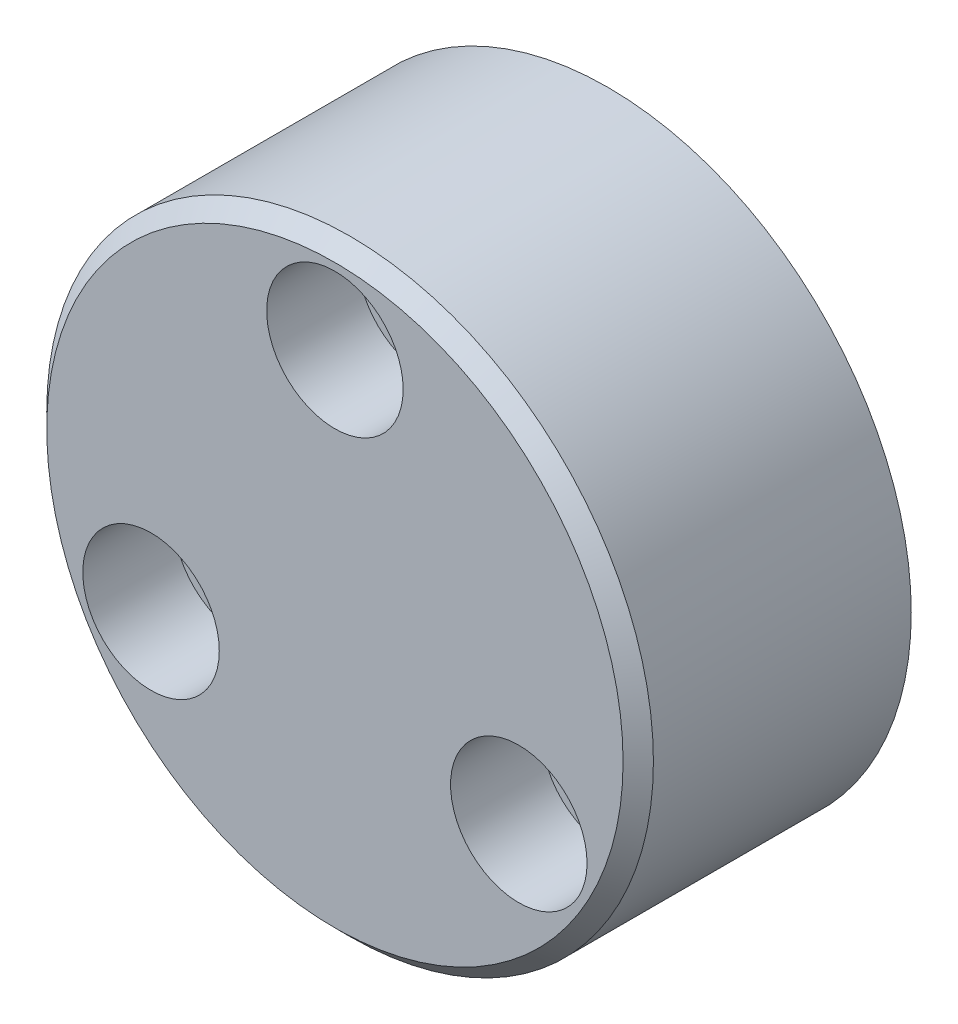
ISO-10303-21;
HEADER;
FILE_DESCRIPTION(('STEP AP214'),'2;1');
FILE_NAME('part.step','',(''),(''),'','','');
FILE_SCHEMA(('AUTOMOTIVE_DESIGN { 1 0 10303 214 1 1 1 1 }'));
ENDSEC;
DATA;
#1=APPLICATION_CONTEXT('core data for automotive mechanical design processes');
#2=APPLICATION_PROTOCOL_DEFINITION('international standard','automotive_design',2000,#1);
#3=PRODUCT_CONTEXT('',#1,'mechanical');
#4=PRODUCT('Part','Part','',(#3));
#5=PRODUCT_RELATED_PRODUCT_CATEGORY('part','',(#4));
#6=PRODUCT_DEFINITION_FORMATION('','',#4);
#7=PRODUCT_DEFINITION_CONTEXT('part definition',#1,'design');
#8=PRODUCT_DEFINITION('design','',#6,#7);
#9=PRODUCT_DEFINITION_SHAPE('','',#8);
#10=(LENGTH_UNIT() NAMED_UNIT(*) SI_UNIT(.MILLI.,.METRE.));
#11=(NAMED_UNIT(*) PLANE_ANGLE_UNIT() SI_UNIT($,.RADIAN.));
#12=(NAMED_UNIT(*) SI_UNIT($,.STERADIAN.) SOLID_ANGLE_UNIT());
#13=UNCERTAINTY_MEASURE_WITH_UNIT(LENGTH_MEASURE(1.E-05),#10,'distance_accuracy_value','');
#14=(GEOMETRIC_REPRESENTATION_CONTEXT(3) GLOBAL_UNCERTAINTY_ASSIGNED_CONTEXT((#13)) GLOBAL_UNIT_ASSIGNED_CONTEXT((#10,
#11,#12)) REPRESENTATION_CONTEXT('',''));
#15=CARTESIAN_POINT('',(0.,0.,0.));
#16=DIRECTION('',(0.,0.,1.));
#17=DIRECTION('',(1.,0.,0.));
#18=AXIS2_PLACEMENT_3D('',#15,#16,#17);
#19=CARTESIAN_POINT('',(12.1243556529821,-7.00000000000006,18.));
#20=DIRECTION('',(0.,0.,-1.));
#21=DIRECTION('',(-1.,0.,0.));
#22=AXIS2_PLACEMENT_3D('',#19,#20,#21);
#23=CYLINDRICAL_SURFACE('',#22,2.75);
#24=CARTESIAN_POINT('',(12.1243556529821,-7.00000000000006,0.));
#25=DIRECTION('',(0.,0.,1.));
#26=DIRECTION('',(1.,0.,0.));
#27=AXIS2_PLACEMENT_3D('',#24,#25,#26);
#28=CIRCLE('',#27,2.75);
#29=CARTESIAN_POINT('',(14.8743556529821,-7.00000000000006,0.));
#30=VERTEX_POINT('',#29);
#31=EDGE_CURVE('E101',#30,#30,#28,.T.);
#32=ORIENTED_EDGE('',*,*,#31,.F.);
#33=EDGE_LOOP('',(#32));
#34=FACE_BOUND('',#33,.T.);
#35=CARTESIAN_POINT('',(12.1243556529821,-7.00000000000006,12.));
#36=DIRECTION('',(0.,0.,1.));
#37=DIRECTION('',(1.,0.,0.));
#38=AXIS2_PLACEMENT_3D('',#35,#36,#37);
#39=CIRCLE('',#38,2.75);
#40=CARTESIAN_POINT('',(14.8743556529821,-7.00000000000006,12.));
#41=VERTEX_POINT('',#40);
#42=EDGE_CURVE('E83',#41,#41,#39,.T.);
#43=ORIENTED_EDGE('',*,*,#42,.T.);
#44=EDGE_LOOP('',(#43));
#45=FACE_BOUND('',#44,.T.);
#46=ADVANCED_FACE('F37',(#34,#45),#23,.F.);
#47=CARTESIAN_POINT('',(-12.1243556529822,-6.99999999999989,18.));
#48=DIRECTION('',(0.,0.,-1.));
#49=DIRECTION('',(-1.,0.,0.));
#50=AXIS2_PLACEMENT_3D('',#47,#48,#49);
#51=CYLINDRICAL_SURFACE('',#50,2.75);
#52=CARTESIAN_POINT('',(-12.1243556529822,-6.99999999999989,0.));
#53=DIRECTION('',(0.,0.,1.));
#54=DIRECTION('',(1.,0.,0.));
#55=AXIS2_PLACEMENT_3D('',#52,#53,#54);
#56=CIRCLE('',#55,2.75);
#57=CARTESIAN_POINT('',(-9.37435565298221,-6.99999999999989,0.));
#58=VERTEX_POINT('',#57);
#59=EDGE_CURVE('E98',#58,#58,#56,.T.);
#60=ORIENTED_EDGE('',*,*,#59,.F.);
#61=EDGE_LOOP('',(#60));
#62=FACE_BOUND('',#61,.T.);
#63=CARTESIAN_POINT('',(-12.1243556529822,-6.99999999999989,12.));
#64=DIRECTION('',(0.,0.,1.));
#65=DIRECTION('',(1.,0.,0.));
#66=AXIS2_PLACEMENT_3D('',#63,#64,#65);
#67=CIRCLE('',#66,2.75);
#68=CARTESIAN_POINT('',(-9.37435565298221,-6.99999999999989,12.));
#69=VERTEX_POINT('',#68);
#70=EDGE_CURVE('E90',#69,#69,#67,.T.);
#71=ORIENTED_EDGE('',*,*,#70,.T.);
#72=EDGE_LOOP('',(#71));
#73=FACE_BOUND('',#72,.T.);
#74=ADVANCED_FACE('F168',(#62,#73),#51,.F.);
#75=CARTESIAN_POINT('',(0.,14.,18.));
#76=DIRECTION('',(0.,0.,-1.));
#77=DIRECTION('',(-1.,0.,0.));
#78=AXIS2_PLACEMENT_3D('',#75,#76,#77);
#79=CYLINDRICAL_SURFACE('',#78,2.75);
#80=CARTESIAN_POINT('',(0.,14.,0.));
#81=DIRECTION('',(0.,0.,1.));
#82=DIRECTION('',(1.,0.,0.));
#83=AXIS2_PLACEMENT_3D('',#80,#81,#82);
#84=CIRCLE('',#83,2.75);
#85=CARTESIAN_POINT('',(2.75,14.,0.));
#86=VERTEX_POINT('',#85);
#87=EDGE_CURVE('E104',#86,#86,#84,.T.);
#88=ORIENTED_EDGE('',*,*,#87,.F.);
#89=EDGE_LOOP('',(#88));
#90=FACE_BOUND('',#89,.T.);
#91=CARTESIAN_POINT('',(0.,14.,12.));
#92=DIRECTION('',(0.,0.,1.));
#93=DIRECTION('',(1.,0.,0.));
#94=AXIS2_PLACEMENT_3D('',#91,#92,#93);
#95=CIRCLE('',#94,2.75);
#96=CARTESIAN_POINT('',(2.75,14.,12.));
#97=VERTEX_POINT('',#96);
#98=EDGE_CURVE('E97',#97,#97,#95,.T.);
#99=ORIENTED_EDGE('',*,*,#98,.T.);
#100=EDGE_LOOP('',(#99));
#101=FACE_BOUND('',#100,.T.);
#102=ADVANCED_FACE('F171',(#90,#101),#79,.F.);
#103=CARTESIAN_POINT('',(0.,0.,18.));
#104=DIRECTION('',(0.,0.,1.));
#105=DIRECTION('',(1.,0.,0.));
#106=AXIS2_PLACEMENT_3D('',#103,#104,#105);
#107=PLANE('',#106);
#108=CARTESIAN_POINT('',(12.1243556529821,-7.00000000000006,18.));
#109=DIRECTION('',(0.,0.,1.));
#110=DIRECTION('',(1.,0.,0.));
#111=AXIS2_PLACEMENT_3D('',#108,#109,#110);
#112=CIRCLE('',#111,4.5);
#113=CARTESIAN_POINT('',(16.6243556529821,-7.00000000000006,18.));
#114=VERTEX_POINT('',#113);
#115=EDGE_CURVE('E77',#114,#114,#112,.T.);
#116=ORIENTED_EDGE('',*,*,#115,.F.);
#117=EDGE_LOOP('',(#116));
#118=FACE_BOUND('',#117,.T.);
#119=CARTESIAN_POINT('',(-12.1243556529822,-6.99999999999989,18.));
#120=DIRECTION('',(0.,0.,1.));
#121=DIRECTION('',(1.,0.,0.));
#122=AXIS2_PLACEMENT_3D('',#119,#120,#121);
#123=CIRCLE('',#122,4.5);
#124=CARTESIAN_POINT('',(-7.62435565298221,-6.99999999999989,18.));
#125=VERTEX_POINT('',#124);
#126=EDGE_CURVE('E84',#125,#125,#123,.T.);
#127=ORIENTED_EDGE('',*,*,#126,.F.);
#128=EDGE_LOOP('',(#127));
#129=FACE_BOUND('',#128,.T.);
#130=CARTESIAN_POINT('',(0.,14.,18.));
#131=DIRECTION('',(0.,0.,1.));
#132=DIRECTION('',(1.,0.,0.));
#133=AXIS2_PLACEMENT_3D('',#130,#131,#132);
#134=CIRCLE('',#133,4.5);
#135=CARTESIAN_POINT('',(4.5,14.,18.));
#136=VERTEX_POINT('',#135);
#137=EDGE_CURVE('E91',#136,#136,#134,.T.);
#138=ORIENTED_EDGE('',*,*,#137,.F.);
#139=EDGE_LOOP('',(#138));
#140=FACE_BOUND('',#139,.T.);
#141=CARTESIAN_POINT('',(0.,0.,18.));
#142=DIRECTION('',(0.,0.,1.));
#143=DIRECTION('',(1.,0.,0.));
#144=AXIS2_PLACEMENT_3D('',#141,#142,#143);
#145=CIRCLE('',#144,19.);
#146=CARTESIAN_POINT('',(19.,0.,18.));
#147=VERTEX_POINT('',#146);
#148=EDGE_CURVE('E110',#147,#147,#145,.T.);
#149=ORIENTED_EDGE('',*,*,#148,.T.);
#150=EDGE_LOOP('',(#149));
#151=FACE_BOUND('',#150,.T.);
#152=ADVANCED_FACE('F178',(#118,#129,#140,#151),#107,.T.);
#153=CARTESIAN_POINT('',(0.,0.,0.));
#154=DIRECTION('',(0.,0.,1.));
#155=DIRECTION('',(1.,0.,0.));
#156=AXIS2_PLACEMENT_3D('',#153,#154,#155);
#157=PLANE('',#156);
#158=CARTESIAN_POINT('',(0.,0.,0.));
#159=DIRECTION('',(0.,0.,-1.));
#160=DIRECTION('',(-1.,0.,0.));
#161=AXIS2_PLACEMENT_3D('',#158,#159,#160);
#162=CIRCLE('',#161,3.99999999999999);
#163=CARTESIAN_POINT('',(-3.99999999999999,0.,0.));
#164=VERTEX_POINT('',#163);
#165=EDGE_CURVE('E65',#164,#164,#162,.T.);
#166=ORIENTED_EDGE('',*,*,#165,.F.);
#167=EDGE_LOOP('',(#166));
#168=FACE_BOUND('',#167,.T.);
#169=ORIENTED_EDGE('',*,*,#31,.T.);
#170=EDGE_LOOP('',(#169));
#171=FACE_BOUND('',#170,.T.);
#172=CARTESIAN_POINT('',(0.,0.,0.));
#173=DIRECTION('',(0.,0.,1.));
#174=DIRECTION('',(1.,0.,0.));
#175=AXIS2_PLACEMENT_3D('',#172,#173,#174);
#176=CIRCLE('',#175,20.);
#177=CARTESIAN_POINT('',(20.,0.,0.));
#178=VERTEX_POINT('',#177);
#179=EDGE_CURVE('E107',#178,#178,#176,.T.);
#180=ORIENTED_EDGE('',*,*,#179,.F.);
#181=EDGE_LOOP('',(#180));
#182=FACE_BOUND('',#181,.T.);
#183=ORIENTED_EDGE('',*,*,#87,.T.);
#184=EDGE_LOOP('',(#183));
#185=FACE_BOUND('',#184,.T.);
#186=ORIENTED_EDGE('',*,*,#59,.T.);
#187=EDGE_LOOP('',(#186));
#188=FACE_BOUND('',#187,.T.);
#189=ADVANCED_FACE('F180',(#168,#171,#182,#185,#188),#157,.F.);
#190=CARTESIAN_POINT('',(0.,0.,18.));
#191=DIRECTION('',(0.,0.,-1.));
#192=DIRECTION('',(-1.,0.,0.));
#193=AXIS2_PLACEMENT_3D('',#190,#191,#192);
#194=CYLINDRICAL_SURFACE('',#193,20.);
#195=CARTESIAN_POINT('',(0.,-20.,14.));
#196=CARTESIAN_POINT('',(0.164652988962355,-20.0000061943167,14.0000104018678));
#197=CARTESIAN_POINT('',(0.329207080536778,-19.9979626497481,13.9932192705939));
#198=CARTESIAN_POINT('',(0.657107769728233,-19.9898752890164,13.9661779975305));
#199=CARTESIAN_POINT('',(0.820454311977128,-19.983831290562,13.9459272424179));
#200=CARTESIAN_POINT('',(1.3069899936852,-19.959876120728,13.8651130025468));
#201=CARTESIAN_POINT('',(1.62688975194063,-19.9361415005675,13.7844873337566));
#202=CARTESIAN_POINT('',(2.09209536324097,-19.890895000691,13.6258450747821));
#203=CARTESIAN_POINT('',(2.24469091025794,-19.8742101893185,13.5666977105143));
#204=CARTESIAN_POINT('',(2.5442798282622,-19.8380770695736,13.4362909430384));
#205=CARTESIAN_POINT('',(2.69127506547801,-19.8186296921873,13.365035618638));
#206=CARTESIAN_POINT('',(2.97877080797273,-19.7774632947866,13.2109078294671));
#207=CARTESIAN_POINT('',(3.11926848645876,-19.755743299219,13.1280303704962));
#208=CARTESIAN_POINT('',(3.39282129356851,-19.7106054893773,12.9512893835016));
#209=CARTESIAN_POINT('',(3.52587882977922,-19.6871882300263,12.8574294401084));
#210=CARTESIAN_POINT('',(3.78718937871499,-19.6386181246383,12.6567206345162));
#211=CARTESIAN_POINT('',(3.91522491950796,-19.6134358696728,12.5495957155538));
#212=CARTESIAN_POINT('',(4.16183570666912,-19.5625911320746,12.3251488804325));
#213=CARTESIAN_POINT('',(4.28041413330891,-19.5369288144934,12.2078304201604));
#214=CARTESIAN_POINT('',(4.5074763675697,-19.4857950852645,11.9636431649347));
#215=CARTESIAN_POINT('',(4.61595484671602,-19.4603237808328,11.8367693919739));
#216=CARTESIAN_POINT('',(4.82200644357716,-19.4102934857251,11.5743632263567));
#217=CARTESIAN_POINT('',(4.91958354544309,-19.3857341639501,11.4388340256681));
#218=CARTESIAN_POINT('',(5.10532440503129,-19.3376596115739,11.1567125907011));
#219=CARTESIAN_POINT('',(5.19322086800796,-19.3141812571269,11.0099378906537));
#220=CARTESIAN_POINT('',(5.35625892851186,-19.2696038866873,10.7091945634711));
#221=CARTESIAN_POINT('',(5.43140551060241,-19.2485039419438,10.5552287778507));
#222=CARTESIAN_POINT('',(5.56839058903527,-19.2093234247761,10.2410703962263));
#223=CARTESIAN_POINT('',(5.63022616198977,-19.1912435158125,10.0808764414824));
#224=CARTESIAN_POINT('',(5.7400034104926,-19.1586962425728,9.75551241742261));
#225=CARTESIAN_POINT('',(5.78795116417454,-19.1442272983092,9.59034456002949));
#226=CARTESIAN_POINT('',(5.86841419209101,-19.1197132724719,9.26082523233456));
#227=CARTESIAN_POINT('',(5.90131899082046,-19.1095570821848,9.0965771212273));
#228=CARTESIAN_POINT('',(5.95328671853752,-19.0934313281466,8.76576642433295));
#229=CARTESIAN_POINT('',(5.9723552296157,-19.0874600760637,8.59920479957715));
#230=CARTESIAN_POINT('',(5.99648748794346,-19.0798925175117,8.26497342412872));
#231=CARTESIAN_POINT('',(6.00155147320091,-19.0782961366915,8.09730369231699));
#232=CARTESIAN_POINT('',(5.99762541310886,-19.0795307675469,7.76214720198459));
#233=CARTESIAN_POINT('',(5.9886356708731,-19.0823616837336,7.59466043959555));
#234=CARTESIAN_POINT('',(5.95727255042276,-19.0921753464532,7.26722111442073));
#235=CARTESIAN_POINT('',(5.93539727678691,-19.0990035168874,7.10721589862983));
#236=CARTESIAN_POINT('',(5.87886408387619,-19.1164806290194,6.78963681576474));
#237=CARTESIAN_POINT('',(5.8442018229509,-19.1271308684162,6.63206379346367));
#238=CARTESIAN_POINT('',(5.76240333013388,-19.151932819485,6.32052471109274));
#239=CARTESIAN_POINT('',(5.71527077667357,-19.166083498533,6.16655760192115));
#240=CARTESIAN_POINT('',(5.60889138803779,-19.197484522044,5.86313368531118));
#241=CARTESIAN_POINT('',(5.54963996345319,-19.2147360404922,5.71367861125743));
#242=CARTESIAN_POINT('',(5.41860914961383,-19.2521004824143,5.4183119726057));
#243=CARTESIAN_POINT('',(5.34667354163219,-19.2722484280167,5.27247402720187));
#244=CARTESIAN_POINT('',(5.19135839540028,-19.3146649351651,4.98732711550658));
#245=CARTESIAN_POINT('',(5.1079746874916,-19.3369342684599,4.84802055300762));
#246=CARTESIAN_POINT('',(4.84149472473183,-19.4060193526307,4.44123221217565));
#247=CARTESIAN_POINT('',(4.64196639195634,-19.4551429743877,4.18465004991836));
#248=CARTESIAN_POINT('',(4.19522722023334,-19.5564461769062,3.69720964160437));
#249=CARTESIAN_POINT('',(3.94637308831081,-19.6086677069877,3.46787312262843));
#250=CARTESIAN_POINT('',(3.41305957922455,-19.708488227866,3.05379628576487));
#251=CARTESIAN_POINT('',(3.12859796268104,-19.7560869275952,2.8690587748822));
#252=CARTESIAN_POINT('',(2.52941838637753,-19.8417268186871,2.54855699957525));
#253=CARTESIAN_POINT('',(2.21451053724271,-19.8797018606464,2.41312903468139));
#254=CARTESIAN_POINT('',(1.56498212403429,-19.9413407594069,2.19760253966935));
#255=CARTESIAN_POINT('',(1.23036708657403,-19.9650086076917,2.11748857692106));
#256=CARTESIAN_POINT('',(0.563808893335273,-19.9947346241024,2.01739100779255));
#257=CARTESIAN_POINT('',(0.232200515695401,-20.001394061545,1.99535339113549));
#258=CARTESIAN_POINT('',(-0.429998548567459,-19.998116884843,2.00627688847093));
#259=CARTESIAN_POINT('',(-0.760589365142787,-19.9881824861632,2.03923066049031));
#260=CARTESIAN_POINT('',(-1.4036138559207,-19.9532280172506,2.15753768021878));
#261=CARTESIAN_POINT('',(-1.71628897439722,-19.928553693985,2.24169078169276));
#262=CARTESIAN_POINT('',(-2.32302067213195,-19.8669734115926,2.45857570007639));
#263=CARTESIAN_POINT('',(-2.61707500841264,-19.8300659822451,2.59131335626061));
#264=CARTESIAN_POINT('',(-3.18574067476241,-19.7467880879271,2.90500211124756));
#265=CARTESIAN_POINT('',(-3.45974481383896,-19.7002184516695,3.08699757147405));
#266=CARTESIAN_POINT('',(-3.97412373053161,-19.6029315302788,3.49293881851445));
#267=CARTESIAN_POINT('',(-4.21449005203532,-19.5522132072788,3.71689512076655));
#268=CARTESIAN_POINT('',(-4.54922702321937,-19.4760967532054,4.08420798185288));
#269=CARTESIAN_POINT('',(-4.6581855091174,-19.45026064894,4.21447921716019));
#270=CARTESIAN_POINT('',(-4.8647507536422,-19.3996259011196,4.48389870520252));
#271=CARTESIAN_POINT('',(-4.96236157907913,-19.3748268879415,4.62304374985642));
#272=CARTESIAN_POINT('',(-5.14557811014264,-19.3269761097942,4.90937901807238));
#273=CARTESIAN_POINT('',(-5.23117910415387,-19.3039250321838,5.05657236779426));
#274=CARTESIAN_POINT('',(-5.38966081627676,-19.2602780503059,5.3579321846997));
#275=CARTESIAN_POINT('',(-5.46254677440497,-19.2396811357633,5.5120957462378));
#276=CARTESIAN_POINT('',(-5.59476151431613,-19.2016499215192,5.82572301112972));
#277=CARTESIAN_POINT('',(-5.65414703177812,-19.1842024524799,5.98516118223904));
#278=CARTESIAN_POINT('',(-5.75922373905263,-19.1529201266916,6.30876708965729));
#279=CARTESIAN_POINT('',(-5.80492040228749,-19.1390838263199,6.47293290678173));
#280=CARTESIAN_POINT('',(-5.88222586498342,-19.1154663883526,6.80482314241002));
#281=CARTESIAN_POINT('',(-5.91383588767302,-19.1056848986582,6.97254725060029));
#282=CARTESIAN_POINT('',(-5.96266568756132,-19.0905022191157,7.31027182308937));
#283=CARTESIAN_POINT('',(-5.97988601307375,-19.0851008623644,7.48027220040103));
#284=CARTESIAN_POINT('',(-5.99934947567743,-19.0789911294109,7.81405931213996));
#285=CARTESIAN_POINT('',(-6.00218967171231,-19.07809567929,7.97780809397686));
#286=CARTESIAN_POINT('',(-5.99447696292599,-19.0805205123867,8.30501633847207));
#287=CARTESIAN_POINT('',(-5.98391947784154,-19.0838422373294,8.46847568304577));
#288=CARTESIAN_POINT('',(-5.94950873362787,-19.0945978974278,8.79378067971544));
#289=CARTESIAN_POINT('',(-5.9256610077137,-19.1020301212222,8.95562697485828));
#290=CARTESIAN_POINT('',(-5.86487874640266,-19.120779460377,9.27667504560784));
#291=CARTESIAN_POINT('',(-5.82793930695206,-19.1320980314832,9.43587580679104));
#292=CARTESIAN_POINT('',(-5.74185426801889,-19.1581079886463,9.74844216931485));
#293=CARTESIAN_POINT('',(-5.69287144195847,-19.1727542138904,9.90185644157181));
#294=CARTESIAN_POINT('',(-5.58284269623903,-19.205081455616,10.2040260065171));
#295=CARTESIAN_POINT('',(-5.52179244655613,-19.2227635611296,10.352779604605));
#296=CARTESIAN_POINT('',(-5.38811476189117,-19.2606604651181,10.6446121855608));
#297=CARTESIAN_POINT('',(-5.31548980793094,-19.2808747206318,10.7876923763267));
#298=CARTESIAN_POINT('',(-5.15913622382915,-19.3232987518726,11.0674087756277));
#299=CARTESIAN_POINT('',(-5.0754033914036,-19.3455092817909,11.2040425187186));
#300=CARTESIAN_POINT('',(-4.89419285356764,-19.3921618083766,11.4748184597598));
#301=CARTESIAN_POINT('',(-4.79632829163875,-19.4166553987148,11.6086929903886));
#302=CARTESIAN_POINT('',(-4.58990823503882,-19.4664844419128,11.8678412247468));
#303=CARTESIAN_POINT('',(-4.48134875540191,-19.4918202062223,11.9931116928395));
#304=CARTESIAN_POINT('',(-4.25427156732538,-19.5426381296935,12.2342170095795));
#305=CARTESIAN_POINT('',(-4.13575499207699,-19.5681202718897,12.3500529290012));
#306=CARTESIAN_POINT('',(-3.88944109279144,-19.6185640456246,12.5716188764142));
#307=CARTESIAN_POINT('',(-3.76164036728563,-19.6435254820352,12.6773451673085));
#308=CARTESIAN_POINT('',(-3.49372933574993,-19.6929668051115,12.8808781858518));
#309=CARTESIAN_POINT('',(-3.35336894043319,-19.7174114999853,12.9783646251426));
#310=CARTESIAN_POINT('',(-3.06460835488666,-19.7643509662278,13.1611406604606));
#311=CARTESIAN_POINT('',(-2.91620818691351,-19.7868457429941,13.24643029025));
#312=CARTESIAN_POINT('',(-2.61242605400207,-19.8292394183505,13.4041191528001));
#313=CARTESIAN_POINT('',(-2.45704684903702,-19.8491393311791,13.4765234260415));
#314=CARTESIAN_POINT('',(-2.14034959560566,-19.8857816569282,13.6078775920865));
#315=CARTESIAN_POINT('',(-1.9790319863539,-19.902524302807,13.6668284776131));
#316=CARTESIAN_POINT('',(-1.66920359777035,-19.9307619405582,13.765175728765));
#317=CARTESIAN_POINT('',(-1.52117718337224,-19.9426273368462,13.805991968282));
#318=CARTESIAN_POINT('',(-1.22223078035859,-19.963183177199,13.8762044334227));
#319=CARTESIAN_POINT('',(-1.07131010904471,-19.9718728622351,13.9055979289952));
#320=CARTESIAN_POINT('',(-0.615632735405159,-19.9928210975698,13.9762165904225));
#321=CARTESIAN_POINT('',(-0.307643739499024,-19.9999884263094,13.9999805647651));
#322=CARTESIAN_POINT('',(0.,-20.,14.));
#323=B_SPLINE_CURVE_WITH_KNOTS('',3,(#195,#196,#197,#198,#199,#200,#201,#202,#203,#204,#205,
#206,#207,#208,#209,#210,#211,#212,#213,#214,#215,#216,#217,#218,#219,#220,#221,#222,#223,#224,
#225,#226,#227,#228,#229,#230,#231,#232,#233,#234,#235,#236,#237,#238,#239,#240,#241,#242,#243,
#244,#245,#246,#247,#248,#249,#250,#251,#252,#253,#254,#255,#256,#257,#258,#259,#260,#261,#262,
#263,#264,#265,#266,#267,#268,#269,#270,#271,#272,#273,#274,#275,#276,#277,#278,#279,#280,#281,
#282,#283,#284,#285,#286,#287,#288,#289,#290,#291,#292,#293,#294,#295,#296,#297,#298,#299,#300,
#301,#302,#303,#304,#305,#306,#307,#308,#309,#310,#311,#312,#313,#314,#315,#316,#317,#318,#319,
#320,#321,#322),.UNSPECIFIED.,.T.,.F.,(4,2,2,2,2,2,2,2,2,2,2,2,2,2,2,2,2,2,2,2,2,2,2,2,2,2,2,2,
2,2,2,2,2,2,2,2,2,2,2,2,2,2,2,2,2,2,2,2,2,2,2,2,2,2,2,2,2,2,2,2,2,2,2,4),(0.,0.493608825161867,
0.987240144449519,1.97386718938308,2.46696137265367,2.95988977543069,3.4530306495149,
3.9460110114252,4.45191823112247,4.95765459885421,5.46365628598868,5.9694724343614,
6.48689212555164,7.00410906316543,7.52143947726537,8.03854313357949,8.54137016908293,
9.04399423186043,9.54660975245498,10.0492144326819,10.5335590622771,11.0180682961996,
11.5024347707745,11.9869850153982,12.477983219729,12.9691607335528,13.9507580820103,
14.9733478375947,15.9960019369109,17.0255055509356,18.0547218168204,19.0470160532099,
20.0391778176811,21.0089335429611,21.9788058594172,22.9711159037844,23.9636749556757,
24.4785258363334,24.9931916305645,25.5080587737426,26.022713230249,26.535163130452,
27.0474078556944,27.5596080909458,28.0717888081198,28.5625187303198,29.0534164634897,
29.5441099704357,30.0349874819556,30.5195637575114,31.0043142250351,31.4889609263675,
31.9737915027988,32.476111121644,32.9786186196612,33.4810690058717,33.983704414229,
34.5009771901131,35.0182485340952,35.5353170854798,36.0523474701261,36.5138710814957,
36.9755049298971,37.8977819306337),.UNSPECIFIED.);
#324=CARTESIAN_POINT('',(0.,-20.,14.));
#325=VERTEX_POINT('',#324);
#326=EDGE_CURVE('E76',#325,#325,#323,.T.);
#327=ORIENTED_EDGE('',*,*,#326,.T.);
#328=EDGE_LOOP('',(#327));
#329=FACE_BOUND('',#328,.T.);
#330=CARTESIAN_POINT('',(0.,0.,17.));
#331=DIRECTION('',(0.,0.,1.));
#332=DIRECTION('',(1.,0.,0.));
#333=AXIS2_PLACEMENT_3D('',#330,#331,#332);
#334=CIRCLE('',#333,20.);
#335=CARTESIAN_POINT('',(20.,0.,17.));
#336=VERTEX_POINT('',#335);
#337=EDGE_CURVE('E113',#336,#336,#334,.F.);
#338=ORIENTED_EDGE('',*,*,#337,.T.);
#339=EDGE_LOOP('',(#338));
#340=FACE_BOUND('',#339,.T.);
#341=ORIENTED_EDGE('',*,*,#179,.T.);
#342=EDGE_LOOP('',(#341));
#343=FACE_BOUND('',#342,.T.);
#344=ADVANCED_FACE('F39',(#329,#340,#343),#194,.T.);
#345=CARTESIAN_POINT('',(0.,0.,18.));
#346=DIRECTION('',(0.,0.,-1.));
#347=DIRECTION('',(-1.,0.,0.));
#348=AXIS2_PLACEMENT_3D('',#345,#346,#347);
#349=CONICAL_SURFACE('',#348,19.,0.785398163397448);
#350=ORIENTED_EDGE('',*,*,#337,.F.);
#351=EDGE_LOOP('',(#350));
#352=FACE_BOUND('',#351,.T.);
#353=ORIENTED_EDGE('',*,*,#148,.F.);
#354=EDGE_LOOP('',(#353));
#355=FACE_BOUND('',#354,.T.);
#356=ADVANCED_FACE('F163',(#352,#355),#349,.T.);
#357=CARTESIAN_POINT('',(0.,14.,12.));
#358=DIRECTION('',(0.,0.,1.));
#359=DIRECTION('',(1.,0.,0.));
#360=AXIS2_PLACEMENT_3D('',#357,#358,#359);
#361=CYLINDRICAL_SURFACE('',#360,4.5);
#362=CARTESIAN_POINT('',(0.,14.,12.));
#363=DIRECTION('',(0.,0.,1.));
#364=DIRECTION('',(1.,0.,0.));
#365=AXIS2_PLACEMENT_3D('',#362,#363,#364);
#366=CIRCLE('',#365,4.5);
#367=CARTESIAN_POINT('',(4.5,14.,12.));
#368=VERTEX_POINT('',#367);
#369=EDGE_CURVE('E94',#368,#368,#366,.T.);
#370=ORIENTED_EDGE('',*,*,#369,.F.);
#371=EDGE_LOOP('',(#370));
#372=FACE_BOUND('',#371,.T.);
#373=ORIENTED_EDGE('',*,*,#137,.T.);
#374=EDGE_LOOP('',(#373));
#375=FACE_BOUND('',#374,.T.);
#376=ADVANCED_FACE('F159',(#372,#375),#361,.F.);
#377=CARTESIAN_POINT('',(0.,14.,12.));
#378=DIRECTION('',(0.,0.,1.));
#379=DIRECTION('',(1.,0.,0.));
#380=AXIS2_PLACEMENT_3D('',#377,#378,#379);
#381=PLANE('',#380);
#382=ORIENTED_EDGE('',*,*,#98,.F.);
#383=EDGE_LOOP('',(#382));
#384=FACE_BOUND('',#383,.T.);
#385=ORIENTED_EDGE('',*,*,#369,.T.);
#386=EDGE_LOOP('',(#385));
#387=FACE_BOUND('',#386,.T.);
#388=ADVANCED_FACE('F155',(#384,#387),#381,.T.);
#389=CARTESIAN_POINT('',(-12.1243556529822,-6.99999999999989,12.));
#390=DIRECTION('',(0.,0.,1.));
#391=DIRECTION('',(1.,0.,0.));
#392=AXIS2_PLACEMENT_3D('',#389,#390,#391);
#393=CYLINDRICAL_SURFACE('',#392,4.5);
#394=CARTESIAN_POINT('',(-12.1243556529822,-6.99999999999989,12.));
#395=DIRECTION('',(0.,0.,1.));
#396=DIRECTION('',(1.,0.,0.));
#397=AXIS2_PLACEMENT_3D('',#394,#395,#396);
#398=CIRCLE('',#397,4.5);
#399=CARTESIAN_POINT('',(-7.62435565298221,-6.99999999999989,12.));
#400=VERTEX_POINT('',#399);
#401=EDGE_CURVE('E87',#400,#400,#398,.T.);
#402=ORIENTED_EDGE('',*,*,#401,.F.);
#403=EDGE_LOOP('',(#402));
#404=FACE_BOUND('',#403,.T.);
#405=ORIENTED_EDGE('',*,*,#126,.T.);
#406=EDGE_LOOP('',(#405));
#407=FACE_BOUND('',#406,.T.);
#408=ADVANCED_FACE('F151',(#404,#407),#393,.F.);
#409=CARTESIAN_POINT('',(-12.1243556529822,-6.99999999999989,12.));
#410=DIRECTION('',(0.,0.,1.));
#411=DIRECTION('',(1.,0.,0.));
#412=AXIS2_PLACEMENT_3D('',#409,#410,#411);
#413=PLANE('',#412);
#414=ORIENTED_EDGE('',*,*,#70,.F.);
#415=EDGE_LOOP('',(#414));
#416=FACE_BOUND('',#415,.T.);
#417=ORIENTED_EDGE('',*,*,#401,.T.);
#418=EDGE_LOOP('',(#417));
#419=FACE_BOUND('',#418,.T.);
#420=ADVANCED_FACE('F147',(#416,#419),#413,.T.);
#421=CARTESIAN_POINT('',(12.1243556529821,-7.00000000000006,12.));
#422=DIRECTION('',(0.,0.,1.));
#423=DIRECTION('',(1.,0.,0.));
#424=AXIS2_PLACEMENT_3D('',#421,#422,#423);
#425=CYLINDRICAL_SURFACE('',#424,4.5);
#426=CARTESIAN_POINT('',(12.1243556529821,-7.00000000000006,12.));
#427=DIRECTION('',(0.,0.,1.));
#428=DIRECTION('',(1.,0.,0.));
#429=AXIS2_PLACEMENT_3D('',#426,#427,#428);
#430=CIRCLE('',#429,4.5);
#431=CARTESIAN_POINT('',(16.6243556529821,-7.00000000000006,12.));
#432=VERTEX_POINT('',#431);
#433=EDGE_CURVE('E80',#432,#432,#430,.T.);
#434=ORIENTED_EDGE('',*,*,#433,.F.);
#435=EDGE_LOOP('',(#434));
#436=FACE_BOUND('',#435,.T.);
#437=ORIENTED_EDGE('',*,*,#115,.T.);
#438=EDGE_LOOP('',(#437));
#439=FACE_BOUND('',#438,.T.);
#440=ADVANCED_FACE('F143',(#436,#439),#425,.F.);
#441=CARTESIAN_POINT('',(12.1243556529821,-7.00000000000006,12.));
#442=DIRECTION('',(0.,0.,1.));
#443=DIRECTION('',(1.,0.,0.));
#444=AXIS2_PLACEMENT_3D('',#441,#442,#443);
#445=PLANE('',#444);
#446=ORIENTED_EDGE('',*,*,#42,.F.);
#447=EDGE_LOOP('',(#446));
#448=FACE_BOUND('',#447,.T.);
#449=ORIENTED_EDGE('',*,*,#433,.T.);
#450=EDGE_LOOP('',(#449));
#451=FACE_BOUND('',#450,.T.);
#452=ADVANCED_FACE('F132',(#448,#451),#445,.T.);
#453=CARTESIAN_POINT('',(0.,5.71428571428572,8.));
#454=DIRECTION('',(0.,1.,0.));
#455=DIRECTION('',(0.,0.,1.));
#456=AXIS2_PLACEMENT_3D('',#453,#454,#455);
#457=CYLINDRICAL_SURFACE('',#456,6.);
#458=CARTESIAN_POINT('',(0.,-6.,8.));
#459=DIRECTION('',(0.,1.,0.));
#460=DIRECTION('',(0.,0.,1.));
#461=AXIS2_PLACEMENT_3D('',#458,#459,#460);
#462=CIRCLE('',#461,6.);
#463=CARTESIAN_POINT('',(0.,-6.,14.));
#464=VERTEX_POINT('',#463);
#465=EDGE_CURVE('E68',#464,#464,#462,.T.);
#466=ORIENTED_EDGE('',*,*,#465,.T.);
#467=EDGE_LOOP('',(#466));
#468=FACE_BOUND('',#467,.T.);
#469=ORIENTED_EDGE('',*,*,#326,.F.);
#470=EDGE_LOOP('',(#469));
#471=FACE_BOUND('',#470,.T.);
#472=ADVANCED_FACE('F126',(#468,#471),#457,.F.);
#473=CARTESIAN_POINT('',(0.,5.71428571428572,8.));
#474=DIRECTION('',(0.,1.,0.));
#475=DIRECTION('',(0.,0.,1.));
#476=AXIS2_PLACEMENT_3D('',#473,#474,#475);
#477=CYLINDRICAL_SURFACE('',#476,4.);
#478=CARTESIAN_POINT('',(0.,-4.84529946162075,8.));
#479=DIRECTION('',(0.,1.,0.));
#480=DIRECTION('',(0.,0.,1.));
#481=AXIS2_PLACEMENT_3D('',#478,#479,#480);
#482=CIRCLE('',#481,4.);
#483=CARTESIAN_POINT('',(0.,-4.84529946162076,12.));
#484=VERTEX_POINT('',#483);
#485=EDGE_CURVE('E73',#484,#484,#482,.T.);
#486=ORIENTED_EDGE('',*,*,#485,.F.);
#487=EDGE_LOOP('',(#486));
#488=FACE_BOUND('',#487,.T.);
#489=CARTESIAN_POINT('',(0.,0.,8.));
#490=DIRECTION('',(0.,0.707106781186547,0.707106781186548));
#491=DIRECTION('',(0.,0.707106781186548,-0.707106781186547));
#492=AXIS2_PLACEMENT_3D('',#489,#490,#491);
#493=ELLIPSE('',#492,5.65685424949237,3.99999999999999);
#494=CARTESIAN_POINT('',(-3.99999999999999,0.,8.));
#495=VERTEX_POINT('',#494);
#496=CARTESIAN_POINT('',(3.99999999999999,0.,8.));
#497=VERTEX_POINT('',#496);
#498=EDGE_CURVE('E46',#495,#497,#493,.T.);
#499=ORIENTED_EDGE('',*,*,#498,.T.);
#500=CARTESIAN_POINT('',(0.,0.,8.));
#501=DIRECTION('',(0.,0.707106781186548,-0.707106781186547));
#502=DIRECTION('',(0.,0.707106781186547,0.707106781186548));
#503=AXIS2_PLACEMENT_3D('',#500,#501,#502);
#504=ELLIPSE('',#503,5.65685424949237,3.99999999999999);
#505=EDGE_CURVE('E11',#497,#495,#504,.T.);
#506=ORIENTED_EDGE('',*,*,#505,.T.);
#507=EDGE_LOOP('',(#499,#506));
#508=FACE_BOUND('',#507,.T.);
#509=ADVANCED_FACE('F131',(#488,#508),#477,.F.);
#510=CARTESIAN_POINT('',(0.,-4.84529946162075,8.));
#511=DIRECTION('',(0.,-1.,0.));
#512=DIRECTION('',(0.,0.,-1.));
#513=AXIS2_PLACEMENT_3D('',#510,#511,#512);
#514=CONICAL_SURFACE('',#513,4.,1.0471975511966);
#515=ORIENTED_EDGE('',*,*,#465,.F.);
#516=EDGE_LOOP('',(#515));
#517=FACE_BOUND('',#516,.T.);
#518=ORIENTED_EDGE('',*,*,#485,.T.);
#519=EDGE_LOOP('',(#518));
#520=FACE_BOUND('',#519,.T.);
#521=ADVANCED_FACE('F134',(#517,#520),#514,.F.);
#522=CARTESIAN_POINT('',(0.,0.,0.));
#523=DIRECTION('',(0.,0.,-1.));
#524=DIRECTION('',(-1.,0.,0.));
#525=AXIS2_PLACEMENT_3D('',#522,#523,#524);
#526=CYLINDRICAL_SURFACE('',#525,3.99999999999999);
#527=ORIENTED_EDGE('',*,*,#165,.T.);
#528=EDGE_LOOP('',(#527));
#529=FACE_BOUND('',#528,.T.);
#530=CARTESIAN_POINT('',(0.,0.,13.));
#531=DIRECTION('',(0.,0.,-1.));
#532=DIRECTION('',(-1.,0.,0.));
#533=AXIS2_PLACEMENT_3D('',#530,#531,#532);
#534=CIRCLE('',#533,3.99999999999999);
#535=CARTESIAN_POINT('',(-3.99999999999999,0.,13.));
#536=VERTEX_POINT('',#535);
#537=EDGE_CURVE('E63',#536,#536,#534,.T.);
#538=ORIENTED_EDGE('',*,*,#537,.F.);
#539=EDGE_LOOP('',(#538));
#540=FACE_BOUND('',#539,.T.);
#541=ORIENTED_EDGE('',*,*,#498,.F.);
#542=ORIENTED_EDGE('',*,*,#505,.F.);
#543=EDGE_LOOP('',(#541,#542));
#544=FACE_BOUND('',#543,.T.);
#545=ADVANCED_FACE('F59',(#529,#540,#544),#526,.F.);
#546=CARTESIAN_POINT('',(0.,0.,13.));
#547=DIRECTION('',(0.,0.,-1.));
#548=DIRECTION('',(-1.,0.,0.));
#549=AXIS2_PLACEMENT_3D('',#546,#547,#548);
#550=CONICAL_SURFACE('',#549,3.99999999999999,1.02974425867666);
#551=CARTESIAN_POINT('',(0.,0.,15.4034424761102));
#552=VERTEX_POINT('',#551);
#553=VERTEX_LOOP('',#552);
#554=FACE_BOUND('',#553,.T.);
#555=ORIENTED_EDGE('',*,*,#537,.T.);
#556=EDGE_LOOP('',(#555));
#557=FACE_BOUND('',#556,.T.);
#558=ADVANCED_FACE('F56',(#554,#557),#550,.F.);
#559=CLOSED_SHELL('',(#46,#74,#102,#152,#189,#344,#356,#376,#388,#408,#420,#440,#452,#472,#509,
#521,#545,#558));
#560=MANIFOLD_SOLID_BREP('B2',#559);
#561=ADVANCED_BREP_SHAPE_REPRESENTATION('',(#18,#560),#14);
#562=SHAPE_DEFINITION_REPRESENTATION(#9,#561);
ENDSEC;
END-ISO-10303-21;
